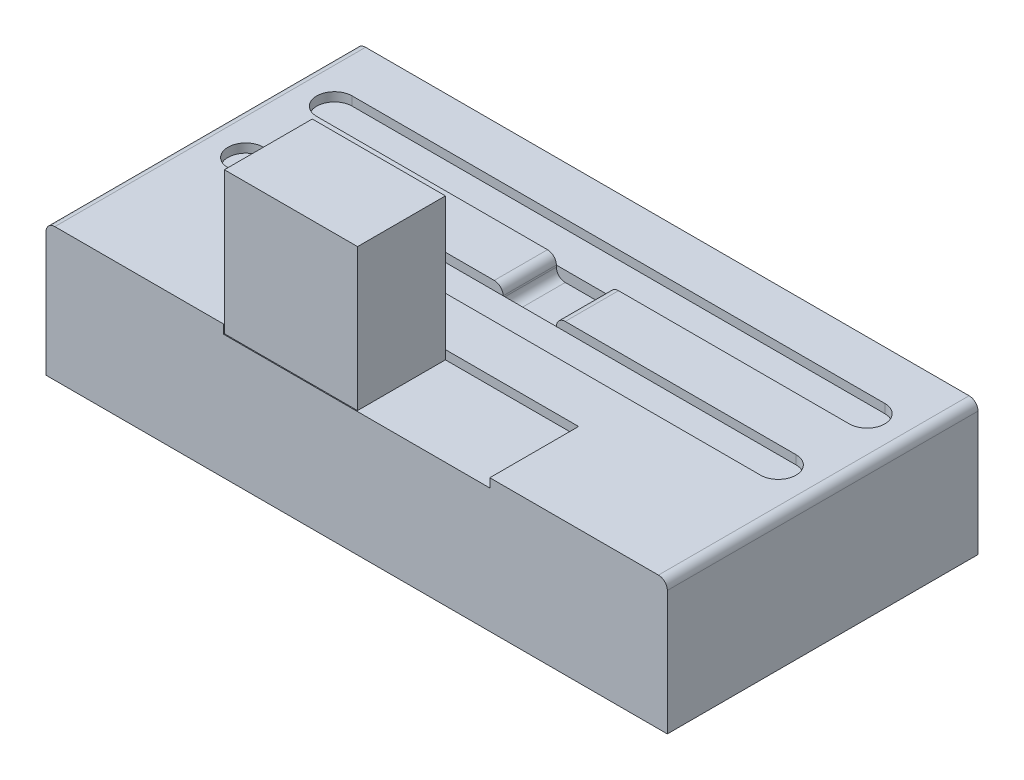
ISO-10303-21;
HEADER;
FILE_DESCRIPTION(('STEP AP214'),'2;1');
FILE_NAME('part.step','',(''),(''),'','','');
FILE_SCHEMA(('AUTOMOTIVE_DESIGN { 1 0 10303 214 1 1 1 1 }'));
ENDSEC;
DATA;
#1=APPLICATION_CONTEXT('core data for automotive mechanical design processes');
#2=APPLICATION_PROTOCOL_DEFINITION('international standard','automotive_design',2000,#1);
#3=PRODUCT_CONTEXT('',#1,'mechanical');
#4=PRODUCT('Part','Part','',(#3));
#5=PRODUCT_RELATED_PRODUCT_CATEGORY('part','',(#4));
#6=PRODUCT_DEFINITION_FORMATION('','',#4);
#7=PRODUCT_DEFINITION_CONTEXT('part definition',#1,'design');
#8=PRODUCT_DEFINITION('design','',#6,#7);
#9=PRODUCT_DEFINITION_SHAPE('','',#8);
#10=(LENGTH_UNIT() NAMED_UNIT(*) SI_UNIT(.MILLI.,.METRE.));
#11=(NAMED_UNIT(*) PLANE_ANGLE_UNIT() SI_UNIT($,.RADIAN.));
#12=(NAMED_UNIT(*) SI_UNIT($,.STERADIAN.) SOLID_ANGLE_UNIT());
#13=UNCERTAINTY_MEASURE_WITH_UNIT(LENGTH_MEASURE(1.E-05),#10,'distance_accuracy_value','');
#14=(GEOMETRIC_REPRESENTATION_CONTEXT(3) GLOBAL_UNCERTAINTY_ASSIGNED_CONTEXT((#13)) GLOBAL_UNIT_ASSIGNED_CONTEXT((#10,
#11,#12)) REPRESENTATION_CONTEXT('',''));
#15=CARTESIAN_POINT('',(0.,0.,0.));
#16=DIRECTION('',(0.,0.,1.));
#17=DIRECTION('',(1.,0.,0.));
#18=AXIS2_PLACEMENT_3D('',#15,#16,#17);
#19=CARTESIAN_POINT('',(-3.,1.4,-0.800000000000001));
#20=DIRECTION('',(0.,0.,1.));
#21=DIRECTION('',(1.,0.,0.));
#22=AXIS2_PLACEMENT_3D('',#19,#20,#21);
#23=PLANE('',#22);
#24=DIRECTION('',(1.,0.,0.));
#25=VECTOR('',#24,1.);
#26=CARTESIAN_POINT('',(-3.,1.5,-0.800000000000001));
#27=LINE('',#26,#25);
#28=CARTESIAN_POINT('',(-3.,1.5,-0.800000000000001));
#29=VERTEX_POINT('',#28);
#30=CARTESIAN_POINT('',(-0.4,1.5,-0.800000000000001));
#31=VERTEX_POINT('',#30);
#32=EDGE_CURVE('E423',#29,#31,#27,.T.);
#33=ORIENTED_EDGE('',*,*,#32,.T.);
#34=CARTESIAN_POINT('',(-0.4,1.4,-0.800000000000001));
#35=DIRECTION('',(0.,0.,1.));
#36=DIRECTION('',(1.,0.,0.));
#37=AXIS2_PLACEMENT_3D('',#34,#35,#36);
#38=CIRCLE('',#37,0.1);
#39=CARTESIAN_POINT('',(-0.3,1.4,-0.800000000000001));
#40=VERTEX_POINT('',#39);
#41=EDGE_CURVE('E306',#31,#40,#38,.F.);
#42=ORIENTED_EDGE('',*,*,#41,.T.);
#43=DIRECTION('',(1.,0.,0.));
#44=VECTOR('',#43,1.);
#45=CARTESIAN_POINT('',(-3.,1.4,-0.800000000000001));
#46=LINE('',#45,#44);
#47=CARTESIAN_POINT('',(-3.,1.4,-0.800000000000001));
#48=VERTEX_POINT('',#47);
#49=EDGE_CURVE('E435',#48,#40,#46,.T.);
#50=ORIENTED_EDGE('',*,*,#49,.F.);
#51=DIRECTION('',(0.,1.,0.));
#52=VECTOR('',#51,1.);
#53=CARTESIAN_POINT('',(-3.,1.4,-0.800000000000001));
#54=LINE('',#53,#52);
#55=EDGE_CURVE('E404',#48,#29,#54,.T.);
#56=ORIENTED_EDGE('',*,*,#55,.T.);
#57=EDGE_LOOP('',(#33,#42,#50,#56));
#58=FACE_BOUND('',#57,.T.);
#59=ADVANCED_FACE('F32',(#58),#23,.F.);
#60=CARTESIAN_POINT('',(-3.,1.4,-0.2));
#61=DIRECTION('',(0.,0.,-1.));
#62=DIRECTION('',(-1.,0.,0.));
#63=AXIS2_PLACEMENT_3D('',#60,#61,#62);
#64=PLANE('',#63);
#65=DIRECTION('',(-1.,0.,0.));
#66=VECTOR('',#65,1.);
#67=CARTESIAN_POINT('',(-3.,1.4,-0.2));
#68=LINE('',#67,#66);
#69=CARTESIAN_POINT('',(-0.3,1.4,-0.2));
#70=VERTEX_POINT('',#69);
#71=CARTESIAN_POINT('',(-3.,1.4,-0.2));
#72=VERTEX_POINT('',#71);
#73=EDGE_CURVE('E266',#70,#72,#68,.T.);
#74=ORIENTED_EDGE('',*,*,#73,.F.);
#75=CARTESIAN_POINT('',(-0.4,1.4,-0.2));
#76=DIRECTION('',(0.,0.,-1.));
#77=DIRECTION('',(-1.,0.,0.));
#78=AXIS2_PLACEMENT_3D('',#75,#76,#77);
#79=CIRCLE('',#78,0.1);
#80=CARTESIAN_POINT('',(-0.4,1.5,-0.2));
#81=VERTEX_POINT('',#80);
#82=EDGE_CURVE('E304',#70,#81,#79,.F.);
#83=ORIENTED_EDGE('',*,*,#82,.T.);
#84=DIRECTION('',(-1.,0.,0.));
#85=VECTOR('',#84,1.);
#86=CARTESIAN_POINT('',(-3.,1.5,-0.2));
#87=LINE('',#86,#85);
#88=CARTESIAN_POINT('',(-3.,1.5,-0.2));
#89=VERTEX_POINT('',#88);
#90=EDGE_CURVE('E453',#81,#89,#87,.T.);
#91=ORIENTED_EDGE('',*,*,#90,.T.);
#92=DIRECTION('',(0.,1.,0.));
#93=VECTOR('',#92,1.);
#94=CARTESIAN_POINT('',(-3.,1.4,-0.2));
#95=LINE('',#94,#93);
#96=EDGE_CURVE('E448',#72,#89,#95,.T.);
#97=ORIENTED_EDGE('',*,*,#96,.F.);
#98=EDGE_LOOP('',(#74,#83,#91,#97));
#99=FACE_BOUND('',#98,.T.);
#100=ADVANCED_FACE('F530',(#99),#64,.F.);
#101=CARTESIAN_POINT('',(-1.5,1.4,1.75));
#102=DIRECTION('',(-1.,0.,0.));
#103=DIRECTION('',(0.,0.,1.));
#104=AXIS2_PLACEMENT_3D('',#101,#102,#103);
#105=PLANE('',#104);
#106=DIRECTION('',(0.,-1.,0.));
#107=VECTOR('',#106,1.);
#108=CARTESIAN_POINT('',(-1.5,3.,1.74));
#109=LINE('',#108,#107);
#110=CARTESIAN_POINT('',(-1.5,1.5,1.74));
#111=VERTEX_POINT('',#110);
#112=CARTESIAN_POINT('',(-1.5,1.4,1.74));
#113=VERTEX_POINT('',#112);
#114=EDGE_CURVE('E477',#111,#113,#109,.T.);
#115=ORIENTED_EDGE('',*,*,#114,.F.);
#116=DIRECTION('',(0.,0.,1.));
#117=VECTOR('',#116,1.);
#118=CARTESIAN_POINT('',(-1.5,1.5,1.75));
#119=LINE('',#118,#117);
#120=CARTESIAN_POINT('',(-1.5,1.5,1.75));
#121=VERTEX_POINT('',#120);
#122=EDGE_CURVE('E394',#111,#121,#119,.T.);
#123=ORIENTED_EDGE('',*,*,#122,.T.);
#124=DIRECTION('',(0.,1.,0.));
#125=VECTOR('',#124,1.);
#126=CARTESIAN_POINT('',(-1.5,1.4,1.75));
#127=LINE('',#126,#125);
#128=CARTESIAN_POINT('',(-1.5,1.4,1.75));
#129=VERTEX_POINT('',#128);
#130=EDGE_CURVE('E382',#129,#121,#127,.T.);
#131=ORIENTED_EDGE('',*,*,#130,.F.);
#132=DIRECTION('',(0.,0.,1.));
#133=VECTOR('',#132,1.);
#134=CARTESIAN_POINT('',(-1.5,1.4,1.75));
#135=LINE('',#134,#133);
#136=EDGE_CURVE('E390',#113,#129,#135,.T.);
#137=ORIENTED_EDGE('',*,*,#136,.F.);
#138=EDGE_LOOP('',(#115,#123,#131,#137));
#139=FACE_BOUND('',#138,.T.);
#140=ADVANCED_FACE('F571',(#139),#105,.F.);
#141=CARTESIAN_POINT('',(1.5,1.4,0.750000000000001));
#142=DIRECTION('',(0.,0.,-1.));
#143=DIRECTION('',(-1.,0.,0.));
#144=AXIS2_PLACEMENT_3D('',#141,#142,#143);
#145=PLANE('',#144);
#146=DIRECTION('',(0.,-1.,0.));
#147=VECTOR('',#146,1.);
#148=CARTESIAN_POINT('',(0.,3.,0.750000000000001));
#149=LINE('',#148,#147);
#150=CARTESIAN_POINT('',(0.,1.5,0.750000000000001));
#151=VERTEX_POINT('',#150);
#152=CARTESIAN_POINT('',(0.,1.4,0.750000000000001));
#153=VERTEX_POINT('',#152);
#154=EDGE_CURVE('E470',#151,#153,#149,.T.);
#155=ORIENTED_EDGE('',*,*,#154,.T.);
#156=DIRECTION('',(-1.,0.,0.));
#157=VECTOR('',#156,1.);
#158=CARTESIAN_POINT('',(1.5,1.4,0.750000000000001));
#159=LINE('',#158,#157);
#160=CARTESIAN_POINT('',(1.5,1.4,0.750000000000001));
#161=VERTEX_POINT('',#160);
#162=EDGE_CURVE('E385',#161,#153,#159,.T.);
#163=ORIENTED_EDGE('',*,*,#162,.F.);
#164=DIRECTION('',(0.,1.,0.));
#165=VECTOR('',#164,1.);
#166=CARTESIAN_POINT('',(1.5,1.4,0.750000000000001));
#167=LINE('',#166,#165);
#168=CARTESIAN_POINT('',(1.5,1.5,0.750000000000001));
#169=VERTEX_POINT('',#168);
#170=EDGE_CURVE('E368',#161,#169,#167,.T.);
#171=ORIENTED_EDGE('',*,*,#170,.T.);
#172=DIRECTION('',(-1.,0.,0.));
#173=VECTOR('',#172,1.);
#174=CARTESIAN_POINT('',(1.5,1.5,0.750000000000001));
#175=LINE('',#174,#173);
#176=EDGE_CURVE('E387',#169,#151,#175,.T.);
#177=ORIENTED_EDGE('',*,*,#176,.T.);
#178=EDGE_LOOP('',(#155,#163,#171,#177));
#179=FACE_BOUND('',#178,.T.);
#180=ADVANCED_FACE('F817',(#179),#145,.F.);
#181=CARTESIAN_POINT('',(0.,1.4,0.));
#182=DIRECTION('',(0.,1.,0.));
#183=DIRECTION('',(0.,0.,1.));
#184=AXIS2_PLACEMENT_3D('',#181,#182,#183);
#185=PLANE('',#184);
#186=ORIENTED_EDGE('',*,*,#162,.T.);
#187=DIRECTION('',(0.,0.,-1.));
#188=VECTOR('',#187,1.);
#189=CARTESIAN_POINT('',(0.,1.4,1.74));
#190=LINE('',#189,#188);
#191=CARTESIAN_POINT('',(0.,1.4,1.74));
#192=VERTEX_POINT('',#191);
#193=EDGE_CURVE('E485',#192,#153,#190,.T.);
#194=ORIENTED_EDGE('',*,*,#193,.F.);
#195=DIRECTION('',(1.,0.,0.));
#196=VECTOR('',#195,1.);
#197=CARTESIAN_POINT('',(-1.5,1.4,1.74));
#198=LINE('',#197,#196);
#199=EDGE_CURVE('E482',#113,#192,#198,.T.);
#200=ORIENTED_EDGE('',*,*,#199,.F.);
#201=ORIENTED_EDGE('',*,*,#136,.T.);
#202=DIRECTION('',(1.,0.,0.));
#203=VECTOR('',#202,1.);
#204=CARTESIAN_POINT('',(1.5,1.4,1.75));
#205=LINE('',#204,#203);
#206=CARTESIAN_POINT('',(1.5,1.4,1.75));
#207=VERTEX_POINT('',#206);
#208=EDGE_CURVE('E400',#129,#207,#205,.T.);
#209=ORIENTED_EDGE('',*,*,#208,.T.);
#210=DIRECTION('',(0.,0.,-1.));
#211=VECTOR('',#210,1.);
#212=CARTESIAN_POINT('',(1.5,1.4,1.75));
#213=LINE('',#212,#211);
#214=EDGE_CURVE('E397',#207,#161,#213,.T.);
#215=ORIENTED_EDGE('',*,*,#214,.T.);
#216=EDGE_LOOP('',(#186,#194,#200,#201,#209,#215));
#217=FACE_BOUND('',#216,.T.);
#218=ADVANCED_FACE('F691',(#217),#185,.T.);
#219=CARTESIAN_POINT('',(-3.5,1.5,1.75));
#220=DIRECTION('',(1.,0.,0.));
#221=DIRECTION('',(0.,0.,-1.));
#222=AXIS2_PLACEMENT_3D('',#219,#220,#221);
#223=PLANE('',#222);
#224=DIRECTION('',(0.,-1.,0.));
#225=VECTOR('',#224,1.);
#226=CARTESIAN_POINT('',(-3.5,1.5,1.75));
#227=LINE('',#226,#225);
#228=CARTESIAN_POINT('',(-3.5,1.4,1.75));
#229=VERTEX_POINT('',#228);
#230=CARTESIAN_POINT('',(-3.5,0.,1.75));
#231=VERTEX_POINT('',#230);
#232=EDGE_CURVE('E280',#229,#231,#227,.T.);
#233=ORIENTED_EDGE('',*,*,#232,.F.);
#234=DIRECTION('',(0.,0.,1.));
#235=VECTOR('',#234,1.);
#236=CARTESIAN_POINT('',(-3.5,1.4,-1.75));
#237=LINE('',#236,#235);
#238=CARTESIAN_POINT('',(-3.5,1.4,-1.75));
#239=VERTEX_POINT('',#238);
#240=EDGE_CURVE('E11',#229,#239,#237,.F.);
#241=ORIENTED_EDGE('',*,*,#240,.T.);
#242=DIRECTION('',(0.,-1.,0.));
#243=VECTOR('',#242,1.);
#244=CARTESIAN_POINT('',(-3.5,1.5,-1.75));
#245=LINE('',#244,#243);
#246=CARTESIAN_POINT('',(-3.5,0.,-1.75));
#247=VERTEX_POINT('',#246);
#248=EDGE_CURVE('E351',#239,#247,#245,.T.);
#249=ORIENTED_EDGE('',*,*,#248,.T.);
#250=DIRECTION('',(0.,0.,1.));
#251=VECTOR('',#250,1.);
#252=CARTESIAN_POINT('',(-3.5,0.,1.75));
#253=LINE('',#252,#251);
#254=EDGE_CURVE('E364',#247,#231,#253,.T.);
#255=ORIENTED_EDGE('',*,*,#254,.T.);
#256=EDGE_LOOP('',(#233,#241,#249,#255));
#257=FACE_BOUND('',#256,.T.);
#258=ADVANCED_FACE('F366',(#257),#223,.F.);
#259=CARTESIAN_POINT('',(3.5,1.5,1.75));
#260=DIRECTION('',(0.,0.,-1.));
#261=DIRECTION('',(-1.,0.,0.));
#262=AXIS2_PLACEMENT_3D('',#259,#260,#261);
#263=PLANE('',#262);
#264=DIRECTION('',(0.,-1.,0.));
#265=VECTOR('',#264,1.);
#266=CARTESIAN_POINT('',(3.5,1.5,1.75));
#267=LINE('',#266,#265);
#268=CARTESIAN_POINT('',(3.5,1.4,1.75));
#269=VERTEX_POINT('',#268);
#270=CARTESIAN_POINT('',(3.5,0.,1.75));
#271=VERTEX_POINT('',#270);
#272=EDGE_CURVE('E326',#269,#271,#267,.T.);
#273=ORIENTED_EDGE('',*,*,#272,.F.);
#274=CARTESIAN_POINT('',(3.4,1.4,1.75));
#275=DIRECTION('',(0.,0.,-1.));
#276=DIRECTION('',(-1.,0.,0.));
#277=AXIS2_PLACEMENT_3D('',#274,#275,#276);
#278=CIRCLE('',#277,0.1);
#279=CARTESIAN_POINT('',(3.4,1.5,1.75));
#280=VERTEX_POINT('',#279);
#281=EDGE_CURVE('E40',#269,#280,#278,.F.);
#282=ORIENTED_EDGE('',*,*,#281,.T.);
#283=DIRECTION('',(1.,0.,0.));
#284=VECTOR('',#283,1.);
#285=CARTESIAN_POINT('',(3.5,1.5,1.75));
#286=LINE('',#285,#284);
#287=CARTESIAN_POINT('',(1.5,1.5,1.75));
#288=VERTEX_POINT('',#287);
#289=EDGE_CURVE('E324',#288,#280,#286,.T.);
#290=ORIENTED_EDGE('',*,*,#289,.F.);
#291=DIRECTION('',(0.,1.,0.));
#292=VECTOR('',#291,1.);
#293=CARTESIAN_POINT('',(1.5,1.4,1.75));
#294=LINE('',#293,#292);
#295=EDGE_CURVE('E370',#207,#288,#294,.T.);
#296=ORIENTED_EDGE('',*,*,#295,.F.);
#297=ORIENTED_EDGE('',*,*,#208,.F.);
#298=ORIENTED_EDGE('',*,*,#130,.T.);
#299=CARTESIAN_POINT('',(-3.4,1.5,1.75));
#300=VERTEX_POINT('',#299);
#301=EDGE_CURVE('E337',#300,#121,#286,.T.);
#302=ORIENTED_EDGE('',*,*,#301,.F.);
#303=CARTESIAN_POINT('',(-3.4,1.4,1.75));
#304=DIRECTION('',(0.,0.,-1.));
#305=DIRECTION('',(-1.,0.,0.));
#306=AXIS2_PLACEMENT_3D('',#303,#304,#305);
#307=CIRCLE('',#306,0.1);
#308=EDGE_CURVE('E47',#300,#229,#307,.F.);
#309=ORIENTED_EDGE('',*,*,#308,.T.);
#310=ORIENTED_EDGE('',*,*,#232,.T.);
#311=DIRECTION('',(1.,0.,0.));
#312=VECTOR('',#311,1.);
#313=CARTESIAN_POINT('',(3.5,0.,1.75));
#314=LINE('',#313,#312);
#315=EDGE_CURVE('E357',#231,#271,#314,.T.);
#316=ORIENTED_EDGE('',*,*,#315,.T.);
#317=EDGE_LOOP('',(#273,#282,#290,#296,#297,#298,#302,#309,#310,#316));
#318=FACE_BOUND('',#317,.T.);
#319=ADVANCED_FACE('F322',(#318),#263,.F.);
#320=CARTESIAN_POINT('',(3.5,1.5,1.75));
#321=DIRECTION('',(-1.,0.,0.));
#322=DIRECTION('',(0.,0.,1.));
#323=AXIS2_PLACEMENT_3D('',#320,#321,#322);
#324=PLANE('',#323);
#325=DIRECTION('',(0.,-1.,0.));
#326=VECTOR('',#325,1.);
#327=CARTESIAN_POINT('',(3.5,1.5,-1.75));
#328=LINE('',#327,#326);
#329=CARTESIAN_POINT('',(3.5,1.4,-1.75));
#330=VERTEX_POINT('',#329);
#331=CARTESIAN_POINT('',(3.5,0.,-1.75));
#332=VERTEX_POINT('',#331);
#333=EDGE_CURVE('E344',#330,#332,#328,.T.);
#334=ORIENTED_EDGE('',*,*,#333,.F.);
#335=DIRECTION('',(0.,0.,-1.));
#336=VECTOR('',#335,1.);
#337=CARTESIAN_POINT('',(3.5,1.4,1.75));
#338=LINE('',#337,#336);
#339=EDGE_CURVE('E55',#330,#269,#338,.F.);
#340=ORIENTED_EDGE('',*,*,#339,.T.);
#341=ORIENTED_EDGE('',*,*,#272,.T.);
#342=DIRECTION('',(0.,0.,-1.));
#343=VECTOR('',#342,1.);
#344=CARTESIAN_POINT('',(3.5,0.,1.75));
#345=LINE('',#344,#343);
#346=EDGE_CURVE('E349',#271,#332,#345,.T.);
#347=ORIENTED_EDGE('',*,*,#346,.T.);
#348=EDGE_LOOP('',(#334,#340,#341,#347));
#349=FACE_BOUND('',#348,.T.);
#350=ADVANCED_FACE('F347',(#349),#324,.F.);
#351=CARTESIAN_POINT('',(3.5,1.5,-1.75));
#352=DIRECTION('',(0.,0.,1.));
#353=DIRECTION('',(1.,0.,0.));
#354=AXIS2_PLACEMENT_3D('',#351,#352,#353);
#355=PLANE('',#354);
#356=DIRECTION('',(-1.,0.,0.));
#357=VECTOR('',#356,1.);
#358=CARTESIAN_POINT('',(3.5,1.5,-1.75));
#359=LINE('',#358,#357);
#360=CARTESIAN_POINT('',(3.4,1.5,-1.75));
#361=VERTEX_POINT('',#360);
#362=CARTESIAN_POINT('',(-3.4,1.5,-1.75));
#363=VERTEX_POINT('',#362);
#364=EDGE_CURVE('E346',#361,#363,#359,.T.);
#365=ORIENTED_EDGE('',*,*,#364,.F.);
#366=CARTESIAN_POINT('',(3.4,1.4,-1.75));
#367=DIRECTION('',(0.,0.,1.));
#368=DIRECTION('',(1.,0.,0.));
#369=AXIS2_PLACEMENT_3D('',#366,#367,#368);
#370=CIRCLE('',#369,0.1);
#371=EDGE_CURVE('E316',#361,#330,#370,.F.);
#372=ORIENTED_EDGE('',*,*,#371,.T.);
#373=ORIENTED_EDGE('',*,*,#333,.T.);
#374=DIRECTION('',(-1.,0.,0.));
#375=VECTOR('',#374,1.);
#376=CARTESIAN_POINT('',(3.5,0.,-1.75));
#377=LINE('',#376,#375);
#378=EDGE_CURVE('E338',#332,#247,#377,.T.);
#379=ORIENTED_EDGE('',*,*,#378,.T.);
#380=ORIENTED_EDGE('',*,*,#248,.F.);
#381=CARTESIAN_POINT('',(-3.4,1.4,-1.75));
#382=DIRECTION('',(0.,0.,1.));
#383=DIRECTION('',(1.,0.,0.));
#384=AXIS2_PLACEMENT_3D('',#381,#382,#383);
#385=CIRCLE('',#384,0.1);
#386=EDGE_CURVE('E314',#239,#363,#385,.F.);
#387=ORIENTED_EDGE('',*,*,#386,.T.);
#388=EDGE_LOOP('',(#365,#372,#373,#379,#380,#387));
#389=FACE_BOUND('',#388,.T.);
#390=ADVANCED_FACE('F342',(#389),#355,.F.);
#391=CARTESIAN_POINT('',(0.,1.5,0.));
#392=DIRECTION('',(0.,1.,0.));
#393=DIRECTION('',(0.,0.,1.));
#394=AXIS2_PLACEMENT_3D('',#391,#392,#393);
#395=PLANE('',#394);
#396=CARTESIAN_POINT('',(0.4,1.5,-0.800000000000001));
#397=VERTEX_POINT('',#396);
#398=CARTESIAN_POINT('',(3.,1.5,-0.800000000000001));
#399=VERTEX_POINT('',#398);
#400=EDGE_CURVE('E426',#397,#399,#27,.T.);
#401=ORIENTED_EDGE('',*,*,#400,.F.);
#402=DIRECTION('',(0.,0.,-1.));
#403=VECTOR('',#402,1.);
#404=CARTESIAN_POINT('',(0.4,1.5,-0.2));
#405=LINE('',#404,#403);
#406=CARTESIAN_POINT('',(0.4,1.5,-0.2));
#407=VERTEX_POINT('',#406);
#408=EDGE_CURVE('E241',#397,#407,#405,.F.);
#409=ORIENTED_EDGE('',*,*,#408,.T.);
#410=CARTESIAN_POINT('',(3.,1.5,-0.2));
#411=VERTEX_POINT('',#410);
#412=EDGE_CURVE('E236',#411,#407,#87,.T.);
#413=ORIENTED_EDGE('',*,*,#412,.F.);
#414=CARTESIAN_POINT('',(3.,1.5,0.));
#415=DIRECTION('',(0.,1.,0.));
#416=DIRECTION('',(0.,0.,1.));
#417=AXIS2_PLACEMENT_3D('',#414,#415,#416);
#418=CIRCLE('',#417,0.2);
#419=CARTESIAN_POINT('',(3.,1.5,0.2));
#420=VERTEX_POINT('',#419);
#421=EDGE_CURVE('E454',#420,#411,#418,.T.);
#422=ORIENTED_EDGE('',*,*,#421,.F.);
#423=DIRECTION('',(1.,0.,0.));
#424=VECTOR('',#423,1.);
#425=CARTESIAN_POINT('',(-3.,1.5,0.2));
#426=LINE('',#425,#424);
#427=CARTESIAN_POINT('',(-3.,1.5,0.2));
#428=VERTEX_POINT('',#427);
#429=EDGE_CURVE('E457',#428,#420,#426,.T.);
#430=ORIENTED_EDGE('',*,*,#429,.F.);
#431=CARTESIAN_POINT('',(-3.,1.5,0.));
#432=DIRECTION('',(0.,1.,0.));
#433=DIRECTION('',(0.,0.,1.));
#434=AXIS2_PLACEMENT_3D('',#431,#432,#433);
#435=CIRCLE('',#434,0.2);
#436=EDGE_CURVE('E415',#89,#428,#435,.T.);
#437=ORIENTED_EDGE('',*,*,#436,.F.);
#438=ORIENTED_EDGE('',*,*,#90,.F.);
#439=DIRECTION('',(0.,0.,1.));
#440=VECTOR('',#439,1.);
#441=CARTESIAN_POINT('',(-0.4,1.5,-0.800000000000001));
#442=LINE('',#441,#440);
#443=EDGE_CURVE('E278',#81,#31,#442,.F.);
#444=ORIENTED_EDGE('',*,*,#443,.T.);
#445=ORIENTED_EDGE('',*,*,#32,.F.);
#446=CARTESIAN_POINT('',(-3.,1.5,-1.));
#447=DIRECTION('',(0.,1.,0.));
#448=DIRECTION('',(0.,0.,-1.));
#449=AXIS2_PLACEMENT_3D('',#446,#447,#448);
#450=CIRCLE('',#449,0.2);
#451=CARTESIAN_POINT('',(-3.,1.5,-1.2));
#452=VERTEX_POINT('',#451);
#453=EDGE_CURVE('E427',#452,#29,#450,.T.);
#454=ORIENTED_EDGE('',*,*,#453,.F.);
#455=DIRECTION('',(-1.,0.,0.));
#456=VECTOR('',#455,1.);
#457=CARTESIAN_POINT('',(-3.,1.5,-1.2));
#458=LINE('',#457,#456);
#459=CARTESIAN_POINT('',(3.,1.5,-1.2));
#460=VERTEX_POINT('',#459);
#461=EDGE_CURVE('E416',#460,#452,#458,.T.);
#462=ORIENTED_EDGE('',*,*,#461,.F.);
#463=CARTESIAN_POINT('',(3.,1.5,-1.));
#464=DIRECTION('',(0.,1.,0.));
#465=DIRECTION('',(0.,0.,-1.));
#466=AXIS2_PLACEMENT_3D('',#463,#464,#465);
#467=CIRCLE('',#466,0.2);
#468=EDGE_CURVE('E420',#399,#460,#467,.T.);
#469=ORIENTED_EDGE('',*,*,#468,.F.);
#470=EDGE_LOOP('',(#401,#409,#413,#422,#430,#437,#438,#444,#445,#454,#462,#469));
#471=FACE_BOUND('',#470,.T.);
#472=ORIENTED_EDGE('',*,*,#289,.T.);
#473=DIRECTION('',(0.,0.,-1.));
#474=VECTOR('',#473,1.);
#475=CARTESIAN_POINT('',(3.4,1.5,-1.75));
#476=LINE('',#475,#474);
#477=EDGE_CURVE('E311',#280,#361,#476,.T.);
#478=ORIENTED_EDGE('',*,*,#477,.T.);
#479=ORIENTED_EDGE('',*,*,#364,.T.);
#480=DIRECTION('',(0.,0.,1.));
#481=VECTOR('',#480,1.);
#482=CARTESIAN_POINT('',(-3.4,1.5,1.75));
#483=LINE('',#482,#481);
#484=EDGE_CURVE('E308',#363,#300,#483,.T.);
#485=ORIENTED_EDGE('',*,*,#484,.T.);
#486=ORIENTED_EDGE('',*,*,#301,.T.);
#487=ORIENTED_EDGE('',*,*,#122,.F.);
#488=CARTESIAN_POINT('',(-1.5,1.5,0.750000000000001));
#489=VERTEX_POINT('',#488);
#490=EDGE_CURVE('E392',#489,#111,#119,.T.);
#491=ORIENTED_EDGE('',*,*,#490,.F.);
#492=DIRECTION('',(1.,0.,0.));
#493=VECTOR('',#492,1.);
#494=CARTESIAN_POINT('',(0.,1.5,0.750000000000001));
#495=LINE('',#494,#493);
#496=EDGE_CURVE('E429',#489,#151,#495,.T.);
#497=ORIENTED_EDGE('',*,*,#496,.T.);
#498=ORIENTED_EDGE('',*,*,#176,.F.);
#499=DIRECTION('',(0.,0.,-1.));
#500=VECTOR('',#499,1.);
#501=CARTESIAN_POINT('',(1.5,1.5,1.75));
#502=LINE('',#501,#500);
#503=EDGE_CURVE('E336',#288,#169,#502,.T.);
#504=ORIENTED_EDGE('',*,*,#503,.F.);
#505=EDGE_LOOP('',(#472,#478,#479,#485,#486,#487,#491,#497,#498,#504));
#506=FACE_BOUND('',#505,.T.);
#507=ADVANCED_FACE('F331',(#471,#506),#395,.T.);
#508=CARTESIAN_POINT('',(0.,0.,0.));
#509=DIRECTION('',(0.,1.,0.));
#510=DIRECTION('',(0.,0.,1.));
#511=AXIS2_PLACEMENT_3D('',#508,#509,#510);
#512=PLANE('',#511);
#513=ORIENTED_EDGE('',*,*,#254,.F.);
#514=ORIENTED_EDGE('',*,*,#378,.F.);
#515=ORIENTED_EDGE('',*,*,#346,.F.);
#516=ORIENTED_EDGE('',*,*,#315,.F.);
#517=EDGE_LOOP('',(#513,#514,#515,#516));
#518=FACE_BOUND('',#517,.T.);
#519=ADVANCED_FACE('F363',(#518),#512,.F.);
#520=CARTESIAN_POINT('',(1.5,1.4,1.75));
#521=DIRECTION('',(1.,0.,0.));
#522=DIRECTION('',(0.,0.,-1.));
#523=AXIS2_PLACEMENT_3D('',#520,#521,#522);
#524=PLANE('',#523);
#525=ORIENTED_EDGE('',*,*,#503,.T.);
#526=ORIENTED_EDGE('',*,*,#170,.F.);
#527=ORIENTED_EDGE('',*,*,#214,.F.);
#528=ORIENTED_EDGE('',*,*,#295,.T.);
#529=EDGE_LOOP('',(#525,#526,#527,#528));
#530=FACE_BOUND('',#529,.T.);
#531=ADVANCED_FACE('F868',(#530),#524,.F.);
#532=CARTESIAN_POINT('',(-3.,1.4,-1.));
#533=DIRECTION('',(0.,1.,0.));
#534=DIRECTION('',(0.,0.,1.));
#535=AXIS2_PLACEMENT_3D('',#532,#533,#534);
#536=CYLINDRICAL_SURFACE('',#535,0.2);
#537=ORIENTED_EDGE('',*,*,#453,.T.);
#538=ORIENTED_EDGE('',*,*,#55,.F.);
#539=CARTESIAN_POINT('',(-3.,1.4,-1.));
#540=DIRECTION('',(0.,1.,0.));
#541=DIRECTION('',(0.,0.,-1.));
#542=AXIS2_PLACEMENT_3D('',#539,#540,#541);
#543=CIRCLE('',#542,0.2);
#544=CARTESIAN_POINT('',(-3.,1.4,-1.2));
#545=VERTEX_POINT('',#544);
#546=EDGE_CURVE('E419',#545,#48,#543,.T.);
#547=ORIENTED_EDGE('',*,*,#546,.F.);
#548=DIRECTION('',(0.,1.,0.));
#549=VECTOR('',#548,1.);
#550=CARTESIAN_POINT('',(-3.,1.4,-1.2));
#551=LINE('',#550,#549);
#552=EDGE_CURVE('E413',#545,#452,#551,.T.);
#553=ORIENTED_EDGE('',*,*,#552,.T.);
#554=EDGE_LOOP('',(#537,#538,#547,#553));
#555=FACE_BOUND('',#554,.T.);
#556=ADVANCED_FACE('F563',(#555),#536,.F.);
#557=CARTESIAN_POINT('',(-3.,1.4,-1.2));
#558=DIRECTION('',(0.,0.,-1.));
#559=DIRECTION('',(-1.,0.,0.));
#560=AXIS2_PLACEMENT_3D('',#557,#558,#559);
#561=PLANE('',#560);
#562=ORIENTED_EDGE('',*,*,#461,.T.);
#563=ORIENTED_EDGE('',*,*,#552,.F.);
#564=DIRECTION('',(-1.,0.,0.));
#565=VECTOR('',#564,1.);
#566=CARTESIAN_POINT('',(-3.,1.4,-1.2));
#567=LINE('',#566,#565);
#568=CARTESIAN_POINT('',(3.,1.4,-1.2));
#569=VERTEX_POINT('',#568);
#570=EDGE_CURVE('E408',#569,#545,#567,.T.);
#571=ORIENTED_EDGE('',*,*,#570,.F.);
#572=DIRECTION('',(0.,1.,0.));
#573=VECTOR('',#572,1.);
#574=CARTESIAN_POINT('',(3.,1.4,-1.2));
#575=LINE('',#574,#573);
#576=EDGE_CURVE('E411',#569,#460,#575,.T.);
#577=ORIENTED_EDGE('',*,*,#576,.T.);
#578=EDGE_LOOP('',(#562,#563,#571,#577));
#579=FACE_BOUND('',#578,.T.);
#580=ADVANCED_FACE('F559',(#579),#561,.F.);
#581=CARTESIAN_POINT('',(3.,1.4,-1.));
#582=DIRECTION('',(0.,1.,0.));
#583=DIRECTION('',(0.,0.,1.));
#584=AXIS2_PLACEMENT_3D('',#581,#582,#583);
#585=CYLINDRICAL_SURFACE('',#584,0.2);
#586=ORIENTED_EDGE('',*,*,#468,.T.);
#587=ORIENTED_EDGE('',*,*,#576,.F.);
#588=CARTESIAN_POINT('',(3.,1.4,-1.));
#589=DIRECTION('',(0.,1.,0.));
#590=DIRECTION('',(0.,0.,-1.));
#591=AXIS2_PLACEMENT_3D('',#588,#589,#590);
#592=CIRCLE('',#591,0.2);
#593=CARTESIAN_POINT('',(3.,1.4,-0.800000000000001));
#594=VERTEX_POINT('',#593);
#595=EDGE_CURVE('E432',#594,#569,#592,.T.);
#596=ORIENTED_EDGE('',*,*,#595,.F.);
#597=DIRECTION('',(0.,1.,0.));
#598=VECTOR('',#597,1.);
#599=CARTESIAN_POINT('',(3.,1.4,-0.800000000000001));
#600=LINE('',#599,#598);
#601=EDGE_CURVE('E407',#594,#399,#600,.T.);
#602=ORIENTED_EDGE('',*,*,#601,.T.);
#603=EDGE_LOOP('',(#586,#587,#596,#602));
#604=FACE_BOUND('',#603,.T.);
#605=ADVANCED_FACE('F553',(#604),#585,.F.);
#606=CARTESIAN_POINT('',(0.3,1.4,-0.800000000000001));
#607=VERTEX_POINT('',#606);
#608=EDGE_CURVE('E439',#607,#594,#46,.T.);
#609=ORIENTED_EDGE('',*,*,#608,.F.);
#610=CARTESIAN_POINT('',(0.4,1.4,-0.800000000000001));
#611=DIRECTION('',(0.,0.,1.));
#612=DIRECTION('',(1.,0.,0.));
#613=AXIS2_PLACEMENT_3D('',#610,#611,#612);
#614=CIRCLE('',#613,0.1);
#615=EDGE_CURVE('E276',#607,#397,#614,.F.);
#616=ORIENTED_EDGE('',*,*,#615,.T.);
#617=ORIENTED_EDGE('',*,*,#400,.T.);
#618=ORIENTED_EDGE('',*,*,#601,.F.);
#619=EDGE_LOOP('',(#609,#616,#617,#618));
#620=FACE_BOUND('',#619,.T.);
#621=ADVANCED_FACE('F550',(#620),#23,.F.);
#622=CARTESIAN_POINT('',(-3.,1.4,-1.));
#623=DIRECTION('',(0.,-1.,0.));
#624=DIRECTION('',(0.,0.,-1.));
#625=AXIS2_PLACEMENT_3D('',#622,#623,#624);
#626=PLANE('',#625);
#627=ORIENTED_EDGE('',*,*,#546,.T.);
#628=ORIENTED_EDGE('',*,*,#49,.T.);
#629=EDGE_CURVE('E438',#40,#607,#46,.T.);
#630=ORIENTED_EDGE('',*,*,#629,.T.);
#631=ORIENTED_EDGE('',*,*,#608,.T.);
#632=ORIENTED_EDGE('',*,*,#595,.T.);
#633=ORIENTED_EDGE('',*,*,#570,.T.);
#634=EDGE_LOOP('',(#627,#628,#630,#631,#632,#633));
#635=FACE_BOUND('',#634,.T.);
#636=ADVANCED_FACE('F556',(#635),#626,.F.);
#637=CARTESIAN_POINT('',(-3.,1.4,0.));
#638=DIRECTION('',(0.,1.,0.));
#639=DIRECTION('',(0.,0.,1.));
#640=AXIS2_PLACEMENT_3D('',#637,#638,#639);
#641=CYLINDRICAL_SURFACE('',#640,0.2);
#642=ORIENTED_EDGE('',*,*,#436,.T.);
#643=DIRECTION('',(0.,1.,0.));
#644=VECTOR('',#643,1.);
#645=CARTESIAN_POINT('',(-3.,1.4,0.2));
#646=LINE('',#645,#644);
#647=CARTESIAN_POINT('',(-3.,1.4,0.2));
#648=VERTEX_POINT('',#647);
#649=EDGE_CURVE('E274',#648,#428,#646,.T.);
#650=ORIENTED_EDGE('',*,*,#649,.F.);
#651=CARTESIAN_POINT('',(-3.,1.4,0.));
#652=DIRECTION('',(0.,1.,0.));
#653=DIRECTION('',(0.,0.,1.));
#654=AXIS2_PLACEMENT_3D('',#651,#652,#653);
#655=CIRCLE('',#654,0.2);
#656=EDGE_CURVE('E452',#72,#648,#655,.T.);
#657=ORIENTED_EDGE('',*,*,#656,.F.);
#658=ORIENTED_EDGE('',*,*,#96,.T.);
#659=EDGE_LOOP('',(#642,#650,#657,#658));
#660=FACE_BOUND('',#659,.T.);
#661=ADVANCED_FACE('F539',(#660),#641,.F.);
#662=ORIENTED_EDGE('',*,*,#412,.T.);
#663=CARTESIAN_POINT('',(0.4,1.4,-0.2));
#664=DIRECTION('',(0.,0.,-1.));
#665=DIRECTION('',(-1.,0.,0.));
#666=AXIS2_PLACEMENT_3D('',#663,#664,#665);
#667=CIRCLE('',#666,0.1);
#668=CARTESIAN_POINT('',(0.3,1.4,-0.2));
#669=VERTEX_POINT('',#668);
#670=EDGE_CURVE('E230',#407,#669,#667,.F.);
#671=ORIENTED_EDGE('',*,*,#670,.T.);
#672=CARTESIAN_POINT('',(3.,1.4,-0.2));
#673=VERTEX_POINT('',#672);
#674=EDGE_CURVE('E234',#673,#669,#68,.T.);
#675=ORIENTED_EDGE('',*,*,#674,.F.);
#676=DIRECTION('',(0.,1.,0.));
#677=VECTOR('',#676,1.);
#678=CARTESIAN_POINT('',(3.,1.4,-0.2));
#679=LINE('',#678,#677);
#680=EDGE_CURVE('E446',#673,#411,#679,.T.);
#681=ORIENTED_EDGE('',*,*,#680,.T.);
#682=EDGE_LOOP('',(#662,#671,#675,#681));
#683=FACE_BOUND('',#682,.T.);
#684=ADVANCED_FACE('F232',(#683),#64,.F.);
#685=CARTESIAN_POINT('',(3.,1.4,0.));
#686=DIRECTION('',(0.,1.,0.));
#687=DIRECTION('',(0.,0.,1.));
#688=AXIS2_PLACEMENT_3D('',#685,#686,#687);
#689=CYLINDRICAL_SURFACE('',#688,0.2);
#690=ORIENTED_EDGE('',*,*,#421,.T.);
#691=ORIENTED_EDGE('',*,*,#680,.F.);
#692=CARTESIAN_POINT('',(3.,1.4,0.));
#693=DIRECTION('',(0.,1.,0.));
#694=DIRECTION('',(0.,0.,1.));
#695=AXIS2_PLACEMENT_3D('',#692,#693,#694);
#696=CIRCLE('',#695,0.2);
#697=CARTESIAN_POINT('',(3.,1.4,0.2));
#698=VERTEX_POINT('',#697);
#699=EDGE_CURVE('E273',#698,#673,#696,.T.);
#700=ORIENTED_EDGE('',*,*,#699,.F.);
#701=DIRECTION('',(0.,1.,0.));
#702=VECTOR('',#701,1.);
#703=CARTESIAN_POINT('',(3.,1.4,0.2));
#704=LINE('',#703,#702);
#705=EDGE_CURVE('E444',#698,#420,#704,.T.);
#706=ORIENTED_EDGE('',*,*,#705,.T.);
#707=EDGE_LOOP('',(#690,#691,#700,#706));
#708=FACE_BOUND('',#707,.T.);
#709=ADVANCED_FACE('F545',(#708),#689,.F.);
#710=CARTESIAN_POINT('',(-3.,1.4,0.2));
#711=DIRECTION('',(0.,0.,1.));
#712=DIRECTION('',(1.,0.,0.));
#713=AXIS2_PLACEMENT_3D('',#710,#711,#712);
#714=PLANE('',#713);
#715=ORIENTED_EDGE('',*,*,#429,.T.);
#716=ORIENTED_EDGE('',*,*,#705,.F.);
#717=DIRECTION('',(1.,0.,0.));
#718=VECTOR('',#717,1.);
#719=CARTESIAN_POINT('',(-3.,1.4,0.2));
#720=LINE('',#719,#718);
#721=EDGE_CURVE('E462',#648,#698,#720,.T.);
#722=ORIENTED_EDGE('',*,*,#721,.F.);
#723=ORIENTED_EDGE('',*,*,#649,.T.);
#724=EDGE_LOOP('',(#715,#716,#722,#723));
#725=FACE_BOUND('',#724,.T.);
#726=ADVANCED_FACE('F543',(#725),#714,.F.);
#727=CARTESIAN_POINT('',(-3.,1.4,0.));
#728=DIRECTION('',(0.,1.,0.));
#729=DIRECTION('',(0.,0.,1.));
#730=AXIS2_PLACEMENT_3D('',#727,#728,#729);
#731=PLANE('',#730);
#732=ORIENTED_EDGE('',*,*,#656,.T.);
#733=ORIENTED_EDGE('',*,*,#721,.T.);
#734=ORIENTED_EDGE('',*,*,#699,.T.);
#735=ORIENTED_EDGE('',*,*,#674,.T.);
#736=EDGE_CURVE('E261',#669,#70,#68,.T.);
#737=ORIENTED_EDGE('',*,*,#736,.T.);
#738=ORIENTED_EDGE('',*,*,#73,.T.);
#739=EDGE_LOOP('',(#732,#733,#734,#735,#737,#738));
#740=FACE_BOUND('',#739,.T.);
#741=ADVANCED_FACE('F270',(#740),#731,.T.);
#742=CARTESIAN_POINT('',(0.,3.,1.74));
#743=DIRECTION('',(-1.,0.,0.));
#744=DIRECTION('',(0.,0.,1.));
#745=AXIS2_PLACEMENT_3D('',#742,#743,#744);
#746=PLANE('',#745);
#747=ORIENTED_EDGE('',*,*,#193,.T.);
#748=ORIENTED_EDGE('',*,*,#154,.F.);
#749=CARTESIAN_POINT('',(0.,3.,0.750000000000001));
#750=VERTEX_POINT('',#749);
#751=EDGE_CURVE('E467',#750,#151,#149,.T.);
#752=ORIENTED_EDGE('',*,*,#751,.F.);
#753=DIRECTION('',(0.,0.,-1.));
#754=VECTOR('',#753,1.);
#755=CARTESIAN_POINT('',(0.,3.,1.74));
#756=LINE('',#755,#754);
#757=CARTESIAN_POINT('',(0.,3.,1.74));
#758=VERTEX_POINT('',#757);
#759=EDGE_CURVE('E484',#758,#750,#756,.T.);
#760=ORIENTED_EDGE('',*,*,#759,.F.);
#761=DIRECTION('',(0.,-1.,0.));
#762=VECTOR('',#761,1.);
#763=CARTESIAN_POINT('',(0.,3.,1.74));
#764=LINE('',#763,#762);
#765=EDGE_CURVE('E478',#758,#192,#764,.T.);
#766=ORIENTED_EDGE('',*,*,#765,.T.);
#767=EDGE_LOOP('',(#747,#748,#752,#760,#766));
#768=FACE_BOUND('',#767,.T.);
#769=ADVANCED_FACE('F595',(#768),#746,.F.);
#770=CARTESIAN_POINT('',(-1.5,3.,0.750000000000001));
#771=DIRECTION('',(0.,0.,1.));
#772=DIRECTION('',(1.,0.,0.));
#773=AXIS2_PLACEMENT_3D('',#770,#771,#772);
#774=PLANE('',#773);
#775=ORIENTED_EDGE('',*,*,#496,.F.);
#776=DIRECTION('',(0.,-1.,0.));
#777=VECTOR('',#776,1.);
#778=CARTESIAN_POINT('',(-1.5,3.,0.750000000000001));
#779=LINE('',#778,#777);
#780=CARTESIAN_POINT('',(-1.5,3.,0.750000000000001));
#781=VERTEX_POINT('',#780);
#782=EDGE_CURVE('E471',#781,#489,#779,.T.);
#783=ORIENTED_EDGE('',*,*,#782,.F.);
#784=DIRECTION('',(-1.,0.,0.));
#785=VECTOR('',#784,1.);
#786=CARTESIAN_POINT('',(-1.5,3.,0.750000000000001));
#787=LINE('',#786,#785);
#788=EDGE_CURVE('E491',#750,#781,#787,.T.);
#789=ORIENTED_EDGE('',*,*,#788,.F.);
#790=ORIENTED_EDGE('',*,*,#751,.T.);
#791=EDGE_LOOP('',(#775,#783,#789,#790));
#792=FACE_BOUND('',#791,.T.);
#793=ADVANCED_FACE('F598',(#792),#774,.F.);
#794=CARTESIAN_POINT('',(-1.5,3.,1.74));
#795=DIRECTION('',(1.,0.,0.));
#796=DIRECTION('',(0.,0.,-1.));
#797=AXIS2_PLACEMENT_3D('',#794,#795,#796);
#798=PLANE('',#797);
#799=ORIENTED_EDGE('',*,*,#490,.T.);
#800=CARTESIAN_POINT('',(-1.5,3.,1.74));
#801=VERTEX_POINT('',#800);
#802=EDGE_CURVE('E474',#801,#111,#109,.T.);
#803=ORIENTED_EDGE('',*,*,#802,.F.);
#804=DIRECTION('',(0.,0.,1.));
#805=VECTOR('',#804,1.);
#806=CARTESIAN_POINT('',(-1.5,3.,1.74));
#807=LINE('',#806,#805);
#808=EDGE_CURVE('E489',#781,#801,#807,.T.);
#809=ORIENTED_EDGE('',*,*,#808,.F.);
#810=ORIENTED_EDGE('',*,*,#782,.T.);
#811=EDGE_LOOP('',(#799,#803,#809,#810));
#812=FACE_BOUND('',#811,.T.);
#813=ADVANCED_FACE('F602',(#812),#798,.F.);
#814=CARTESIAN_POINT('',(-1.5,3.,1.74));
#815=DIRECTION('',(0.,0.,-1.));
#816=DIRECTION('',(-1.,0.,0.));
#817=AXIS2_PLACEMENT_3D('',#814,#815,#816);
#818=PLANE('',#817);
#819=ORIENTED_EDGE('',*,*,#199,.T.);
#820=ORIENTED_EDGE('',*,*,#765,.F.);
#821=DIRECTION('',(1.,0.,0.));
#822=VECTOR('',#821,1.);
#823=CARTESIAN_POINT('',(-1.5,3.,1.74));
#824=LINE('',#823,#822);
#825=EDGE_CURVE('E481',#801,#758,#824,.T.);
#826=ORIENTED_EDGE('',*,*,#825,.F.);
#827=ORIENTED_EDGE('',*,*,#802,.T.);
#828=ORIENTED_EDGE('',*,*,#114,.T.);
#829=EDGE_LOOP('',(#819,#820,#826,#827,#828));
#830=FACE_BOUND('',#829,.T.);
#831=ADVANCED_FACE('F606',(#830),#818,.F.);
#832=CARTESIAN_POINT('',(0.,3.,0.));
#833=DIRECTION('',(0.,-1.,0.));
#834=DIRECTION('',(0.,0.,-1.));
#835=AXIS2_PLACEMENT_3D('',#832,#833,#834);
#836=PLANE('',#835);
#837=ORIENTED_EDGE('',*,*,#759,.T.);
#838=ORIENTED_EDGE('',*,*,#788,.T.);
#839=ORIENTED_EDGE('',*,*,#808,.T.);
#840=ORIENTED_EDGE('',*,*,#825,.T.);
#841=EDGE_LOOP('',(#837,#838,#839,#840));
#842=FACE_BOUND('',#841,.T.);
#843=ADVANCED_FACE('F610',(#842),#836,.F.);
#844=CARTESIAN_POINT('',(-0.3,1.28,-0.800000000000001));
#845=DIRECTION('',(0.,0.,-1.));
#846=DIRECTION('',(-1.,0.,0.));
#847=AXIS2_PLACEMENT_3D('',#844,#845,#846);
#848=PLANE('',#847);
#849=DIRECTION('',(-1.,0.,0.));
#850=VECTOR('',#849,1.);
#851=CARTESIAN_POINT('',(-0.3,1.28,-0.800000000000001));
#852=LINE('',#851,#850);
#853=CARTESIAN_POINT('',(0.2,1.28,-0.800000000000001));
#854=VERTEX_POINT('',#853);
#855=CARTESIAN_POINT('',(-0.2,1.28,-0.800000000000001));
#856=VERTEX_POINT('',#855);
#857=EDGE_CURVE('E495',#854,#856,#852,.T.);
#858=ORIENTED_EDGE('',*,*,#857,.F.);
#859=CARTESIAN_POINT('',(0.2,1.38,-0.800000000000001));
#860=DIRECTION('',(0.,0.,-1.));
#861=DIRECTION('',(-1.,0.,0.));
#862=AXIS2_PLACEMENT_3D('',#859,#860,#861);
#863=CIRCLE('',#862,0.1);
#864=CARTESIAN_POINT('',(0.3,1.38,-0.800000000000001));
#865=VERTEX_POINT('',#864);
#866=EDGE_CURVE('E293',#854,#865,#863,.F.);
#867=ORIENTED_EDGE('',*,*,#866,.T.);
#868=DIRECTION('',(0.,1.,0.));
#869=VECTOR('',#868,1.);
#870=CARTESIAN_POINT('',(0.3,1.28,-0.800000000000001));
#871=LINE('',#870,#869);
#872=EDGE_CURVE('E256',#865,#607,#871,.T.);
#873=ORIENTED_EDGE('',*,*,#872,.T.);
#874=ORIENTED_EDGE('',*,*,#629,.F.);
#875=DIRECTION('',(0.,1.,0.));
#876=VECTOR('',#875,1.);
#877=CARTESIAN_POINT('',(-0.3,1.28,-0.800000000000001));
#878=LINE('',#877,#876);
#879=CARTESIAN_POINT('',(-0.3,1.38,-0.800000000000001));
#880=VERTEX_POINT('',#879);
#881=EDGE_CURVE('E487',#880,#40,#878,.T.);
#882=ORIENTED_EDGE('',*,*,#881,.F.);
#883=CARTESIAN_POINT('',(-0.2,1.38,-0.800000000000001));
#884=DIRECTION('',(0.,0.,-1.));
#885=DIRECTION('',(-1.,0.,0.));
#886=AXIS2_PLACEMENT_3D('',#883,#884,#885);
#887=CIRCLE('',#886,0.1);
#888=EDGE_CURVE('E291',#880,#856,#887,.F.);
#889=ORIENTED_EDGE('',*,*,#888,.T.);
#890=EDGE_LOOP('',(#858,#867,#873,#874,#882,#889));
#891=FACE_BOUND('',#890,.T.);
#892=ADVANCED_FACE('F513',(#891),#848,.F.);
#893=CARTESIAN_POINT('',(-0.3,1.28,-0.800000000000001));
#894=DIRECTION('',(-1.,0.,0.));
#895=DIRECTION('',(0.,0.,1.));
#896=AXIS2_PLACEMENT_3D('',#893,#894,#895);
#897=PLANE('',#896);
#898=DIRECTION('',(0.,1.,0.));
#899=VECTOR('',#898,1.);
#900=CARTESIAN_POINT('',(-0.3,1.28,-0.2));
#901=LINE('',#900,#899);
#902=CARTESIAN_POINT('',(-0.3,1.38,-0.2));
#903=VERTEX_POINT('',#902);
#904=EDGE_CURVE('E257',#903,#70,#901,.T.);
#905=ORIENTED_EDGE('',*,*,#904,.F.);
#906=DIRECTION('',(0.,0.,1.));
#907=VECTOR('',#906,1.);
#908=CARTESIAN_POINT('',(-0.3,1.38,-0.800000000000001));
#909=LINE('',#908,#907);
#910=EDGE_CURVE('E302',#903,#880,#909,.F.);
#911=ORIENTED_EDGE('',*,*,#910,.T.);
#912=ORIENTED_EDGE('',*,*,#881,.T.);
#913=DIRECTION('',(0.,0.,1.));
#914=VECTOR('',#913,1.);
#915=CARTESIAN_POINT('',(-0.3,1.4,-0.2));
#916=LINE('',#915,#914);
#917=EDGE_CURVE('E299',#40,#70,#916,.T.);
#918=ORIENTED_EDGE('',*,*,#917,.T.);
#919=EDGE_LOOP('',(#905,#911,#912,#918));
#920=FACE_BOUND('',#919,.T.);
#921=ADVANCED_FACE('F522',(#920),#897,.F.);
#922=CARTESIAN_POINT('',(0.3,1.28,-0.800000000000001));
#923=DIRECTION('',(1.,0.,0.));
#924=DIRECTION('',(0.,0.,-1.));
#925=AXIS2_PLACEMENT_3D('',#922,#923,#924);
#926=PLANE('',#925);
#927=DIRECTION('',(0.,1.,0.));
#928=VECTOR('',#927,1.);
#929=CARTESIAN_POINT('',(0.3,1.28,-0.2));
#930=LINE('',#929,#928);
#931=CARTESIAN_POINT('',(0.3,1.38,-0.2));
#932=VERTEX_POINT('',#931);
#933=EDGE_CURVE('E246',#932,#669,#930,.T.);
#934=ORIENTED_EDGE('',*,*,#933,.T.);
#935=DIRECTION('',(0.,0.,-1.));
#936=VECTOR('',#935,1.);
#937=CARTESIAN_POINT('',(0.3,1.4,-0.800000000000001));
#938=LINE('',#937,#936);
#939=EDGE_CURVE('E250',#669,#607,#938,.T.);
#940=ORIENTED_EDGE('',*,*,#939,.T.);
#941=ORIENTED_EDGE('',*,*,#872,.F.);
#942=DIRECTION('',(0.,0.,-1.));
#943=VECTOR('',#942,1.);
#944=CARTESIAN_POINT('',(0.3,1.38,-0.800000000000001));
#945=LINE('',#944,#943);
#946=EDGE_CURVE('E253',#865,#932,#945,.F.);
#947=ORIENTED_EDGE('',*,*,#946,.T.);
#948=EDGE_LOOP('',(#934,#940,#941,#947));
#949=FACE_BOUND('',#948,.T.);
#950=ADVANCED_FACE('F248',(#949),#926,.F.);
#951=CARTESIAN_POINT('',(-0.3,1.28,-0.2));
#952=DIRECTION('',(0.,0.,1.));
#953=DIRECTION('',(1.,0.,0.));
#954=AXIS2_PLACEMENT_3D('',#951,#952,#953);
#955=PLANE('',#954);
#956=ORIENTED_EDGE('',*,*,#933,.F.);
#957=CARTESIAN_POINT('',(0.2,1.38,-0.2));
#958=DIRECTION('',(0.,0.,1.));
#959=DIRECTION('',(1.,0.,0.));
#960=AXIS2_PLACEMENT_3D('',#957,#958,#959);
#961=CIRCLE('',#960,0.1);
#962=CARTESIAN_POINT('',(0.2,1.28,-0.2));
#963=VERTEX_POINT('',#962);
#964=EDGE_CURVE('E297',#932,#963,#961,.F.);
#965=ORIENTED_EDGE('',*,*,#964,.T.);
#966=DIRECTION('',(1.,0.,0.));
#967=VECTOR('',#966,1.);
#968=CARTESIAN_POINT('',(-0.3,1.28,-0.2));
#969=LINE('',#968,#967);
#970=CARTESIAN_POINT('',(-0.2,1.28,-0.2));
#971=VERTEX_POINT('',#970);
#972=EDGE_CURVE('E502',#971,#963,#969,.T.);
#973=ORIENTED_EDGE('',*,*,#972,.F.);
#974=CARTESIAN_POINT('',(-0.2,1.38,-0.2));
#975=DIRECTION('',(0.,0.,1.));
#976=DIRECTION('',(1.,0.,0.));
#977=AXIS2_PLACEMENT_3D('',#974,#975,#976);
#978=CIRCLE('',#977,0.1);
#979=EDGE_CURVE('E295',#971,#903,#978,.F.);
#980=ORIENTED_EDGE('',*,*,#979,.T.);
#981=ORIENTED_EDGE('',*,*,#904,.T.);
#982=ORIENTED_EDGE('',*,*,#736,.F.);
#983=EDGE_LOOP('',(#956,#965,#973,#980,#981,#982));
#984=FACE_BOUND('',#983,.T.);
#985=ADVANCED_FACE('F262',(#984),#955,.F.);
#986=CARTESIAN_POINT('',(0.,1.28,0.));
#987=DIRECTION('',(0.,1.,0.));
#988=DIRECTION('',(0.,0.,1.));
#989=AXIS2_PLACEMENT_3D('',#986,#987,#988);
#990=PLANE('',#989);
#991=ORIENTED_EDGE('',*,*,#972,.T.);
#992=DIRECTION('',(0.,0.,-1.));
#993=VECTOR('',#992,1.);
#994=CARTESIAN_POINT('',(0.2,1.28,0.));
#995=LINE('',#994,#993);
#996=EDGE_CURVE('E288',#963,#854,#995,.T.);
#997=ORIENTED_EDGE('',*,*,#996,.T.);
#998=ORIENTED_EDGE('',*,*,#857,.T.);
#999=DIRECTION('',(0.,0.,1.));
#1000=VECTOR('',#999,1.);
#1001=CARTESIAN_POINT('',(-0.2,1.28,0.));
#1002=LINE('',#1001,#1000);
#1003=EDGE_CURVE('E240',#856,#971,#1002,.T.);
#1004=ORIENTED_EDGE('',*,*,#1003,.T.);
#1005=EDGE_LOOP('',(#991,#997,#998,#1004));
#1006=FACE_BOUND('',#1005,.T.);
#1007=ADVANCED_FACE('F507',(#1006),#990,.T.);
#1008=CARTESIAN_POINT('',(0.4,1.4,-0.800000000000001));
#1009=DIRECTION('',(0.,0.,1.));
#1010=DIRECTION('',(1.,0.,0.));
#1011=AXIS2_PLACEMENT_3D('',#1008,#1009,#1010);
#1012=CYLINDRICAL_SURFACE('',#1011,0.1);
#1013=ORIENTED_EDGE('',*,*,#670,.F.);
#1014=ORIENTED_EDGE('',*,*,#408,.F.);
#1015=ORIENTED_EDGE('',*,*,#615,.F.);
#1016=ORIENTED_EDGE('',*,*,#939,.F.);
#1017=EDGE_LOOP('',(#1013,#1014,#1015,#1016));
#1018=FACE_BOUND('',#1017,.T.);
#1019=ADVANCED_FACE('F275',(#1018),#1012,.T.);
#1020=CARTESIAN_POINT('',(0.2,1.38,0.));
#1021=DIRECTION('',(0.,0.,-1.));
#1022=DIRECTION('',(-1.,0.,0.));
#1023=AXIS2_PLACEMENT_3D('',#1020,#1021,#1022);
#1024=CYLINDRICAL_SURFACE('',#1023,0.1);
#1025=ORIENTED_EDGE('',*,*,#964,.F.);
#1026=ORIENTED_EDGE('',*,*,#946,.F.);
#1027=ORIENTED_EDGE('',*,*,#866,.F.);
#1028=ORIENTED_EDGE('',*,*,#996,.F.);
#1029=EDGE_LOOP('',(#1025,#1026,#1027,#1028));
#1030=FACE_BOUND('',#1029,.T.);
#1031=ADVANCED_FACE('F511',(#1030),#1024,.F.);
#1032=CARTESIAN_POINT('',(-0.2,1.38,0.));
#1033=DIRECTION('',(0.,0.,1.));
#1034=DIRECTION('',(1.,0.,0.));
#1035=AXIS2_PLACEMENT_3D('',#1032,#1033,#1034);
#1036=CYLINDRICAL_SURFACE('',#1035,0.1);
#1037=ORIENTED_EDGE('',*,*,#888,.F.);
#1038=ORIENTED_EDGE('',*,*,#910,.F.);
#1039=ORIENTED_EDGE('',*,*,#979,.F.);
#1040=ORIENTED_EDGE('',*,*,#1003,.F.);
#1041=EDGE_LOOP('',(#1037,#1038,#1039,#1040));
#1042=FACE_BOUND('',#1041,.T.);
#1043=ADVANCED_FACE('F519',(#1042),#1036,.F.);
#1044=CARTESIAN_POINT('',(-0.4,1.4,-0.800000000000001));
#1045=DIRECTION('',(0.,0.,-1.));
#1046=DIRECTION('',(-1.,0.,0.));
#1047=AXIS2_PLACEMENT_3D('',#1044,#1045,#1046);
#1048=CYLINDRICAL_SURFACE('',#1047,0.1);
#1049=ORIENTED_EDGE('',*,*,#41,.F.);
#1050=ORIENTED_EDGE('',*,*,#443,.F.);
#1051=ORIENTED_EDGE('',*,*,#82,.F.);
#1052=ORIENTED_EDGE('',*,*,#917,.F.);
#1053=EDGE_LOOP('',(#1049,#1050,#1051,#1052));
#1054=FACE_BOUND('',#1053,.T.);
#1055=ADVANCED_FACE('F526',(#1054),#1048,.T.);
#1056=CARTESIAN_POINT('',(3.4,1.4,0.));
#1057=DIRECTION('',(0.,0.,1.));
#1058=DIRECTION('',(1.,0.,0.));
#1059=AXIS2_PLACEMENT_3D('',#1056,#1057,#1058);
#1060=CYLINDRICAL_SURFACE('',#1059,0.1);
#1061=ORIENTED_EDGE('',*,*,#281,.F.);
#1062=ORIENTED_EDGE('',*,*,#339,.F.);
#1063=ORIENTED_EDGE('',*,*,#371,.F.);
#1064=ORIENTED_EDGE('',*,*,#477,.F.);
#1065=EDGE_LOOP('',(#1061,#1062,#1063,#1064));
#1066=FACE_BOUND('',#1065,.T.);
#1067=ADVANCED_FACE('F340',(#1066),#1060,.T.);
#1068=CARTESIAN_POINT('',(-3.4,1.4,0.));
#1069=DIRECTION('',(0.,0.,-1.));
#1070=DIRECTION('',(-1.,0.,0.));
#1071=AXIS2_PLACEMENT_3D('',#1068,#1069,#1070);
#1072=CYLINDRICAL_SURFACE('',#1071,0.1);
#1073=ORIENTED_EDGE('',*,*,#386,.F.);
#1074=ORIENTED_EDGE('',*,*,#240,.F.);
#1075=ORIENTED_EDGE('',*,*,#308,.F.);
#1076=ORIENTED_EDGE('',*,*,#484,.F.);
#1077=EDGE_LOOP('',(#1073,#1074,#1075,#1076));
#1078=FACE_BOUND('',#1077,.T.);
#1079=ADVANCED_FACE('F34',(#1078),#1072,.T.);
#1080=CLOSED_SHELL('',(#59,#100,#140,#180,#218,#258,#319,#350,#390,#507,#519,#531,#556,#580,
#605,#621,#636,#661,#684,#709,#726,#741,#769,#793,#813,#831,#843,#892,#921,#950,#985,#1007,
#1019,#1031,#1043,#1055,#1067,#1079));
#1081=MANIFOLD_SOLID_BREP('B2',#1080);
#1082=ADVANCED_BREP_SHAPE_REPRESENTATION('',(#18,#1081),#14);
#1083=SHAPE_DEFINITION_REPRESENTATION(#9,#1082);
ENDSEC;
END-ISO-10303-21;
